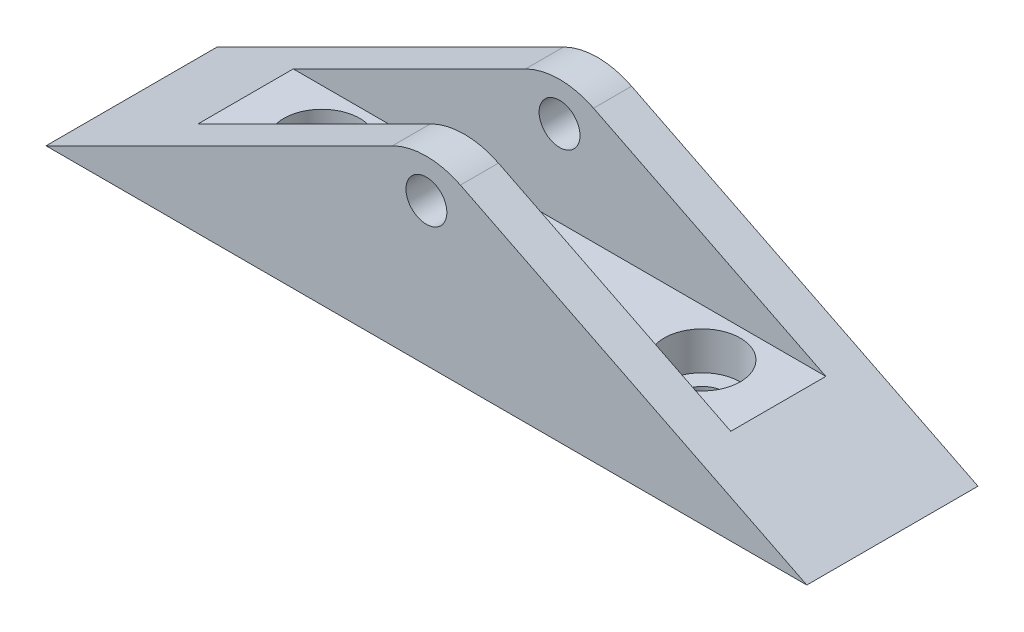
from build123d import *

# Parameters (mm, degrees)
BOSS_EXTRUDE1_DEPTH            = 4
BOSS_EXTRUDE2_DEPTH            = 14
BOSS_EXTRUDE3_START            = 14
BOSS_EXTRUDE3_DEPTH            = 4
F_4_0MM_DOWEL_HOLE1_D          = 4.3
FILLET1_R                      = 8
CBORE_FOR_M4_SHCS1_D           = 4.5
CBORE_FOR_M4_SHCS1_CBORE_D     = 8
CBORE_FOR_M4_SHCS1_CBORE_DEPTH = 4


with BuildPart() as part:
    # Sketch1 → Boss-Extrude1 (new body)
    with BuildSketch(Plane.XY):
        Polygon((-28, 6), (28, 6), (0, 20), align=None)
    extrude(amount=BOSS_EXTRUDE1_DEPTH)

    # Sketch1_3 → Boss-Extrude2 (add)
    with BuildSketch(Plane.XY):
        Polygon((-40, 0), (40, 0), (28, 6), (-28, 6), align=None)
    extrude(amount=BOSS_EXTRUDE2_DEPTH)

    # Sketch1_4 → Boss-Extrude3 (add)
    with BuildSketch(Plane.XY.offset(BOSS_EXTRUDE3_START)):
        Polygon((-28, 6), (28, 6), (0, 20), align=None)
        Polygon((-40, 0), (40, 0), (28, 6), (-28, 6), align=None)
    extrude(amount=BOSS_EXTRUDE3_DEPTH)

    # 4.0mm Dowel Hole1 (through all)
    with Locations(Plane(origin=(0, 0, 0), x_dir=(-1, 0, 0), z_dir=(0, 0, -1))):
        with Locations((0, 15)):
            Hole(F_4_0MM_DOWEL_HOLE1_D / 2)

    # Fillet1
    fillet1_edges = [part.edges().sort_by_distance(p)[0] for p in [
        (0, 20, 16),
        (0, 20, 2),
    ]]
    fillet(fillet1_edges, radius=FILLET1_R)

    # CBORE for M4 SHCS1 (through all)
    with Locations(Plane(origin=(0, 6, 0), x_dir=(1, 0, 0), z_dir=(0, 1, 0))):
        with Locations((-20, -9), (20, -9)):
            CounterBoreHole(CBORE_FOR_M4_SHCS1_D / 2, CBORE_FOR_M4_SHCS1_CBORE_D / 2, CBORE_FOR_M4_SHCS1_CBORE_DEPTH)


solid = part.part
